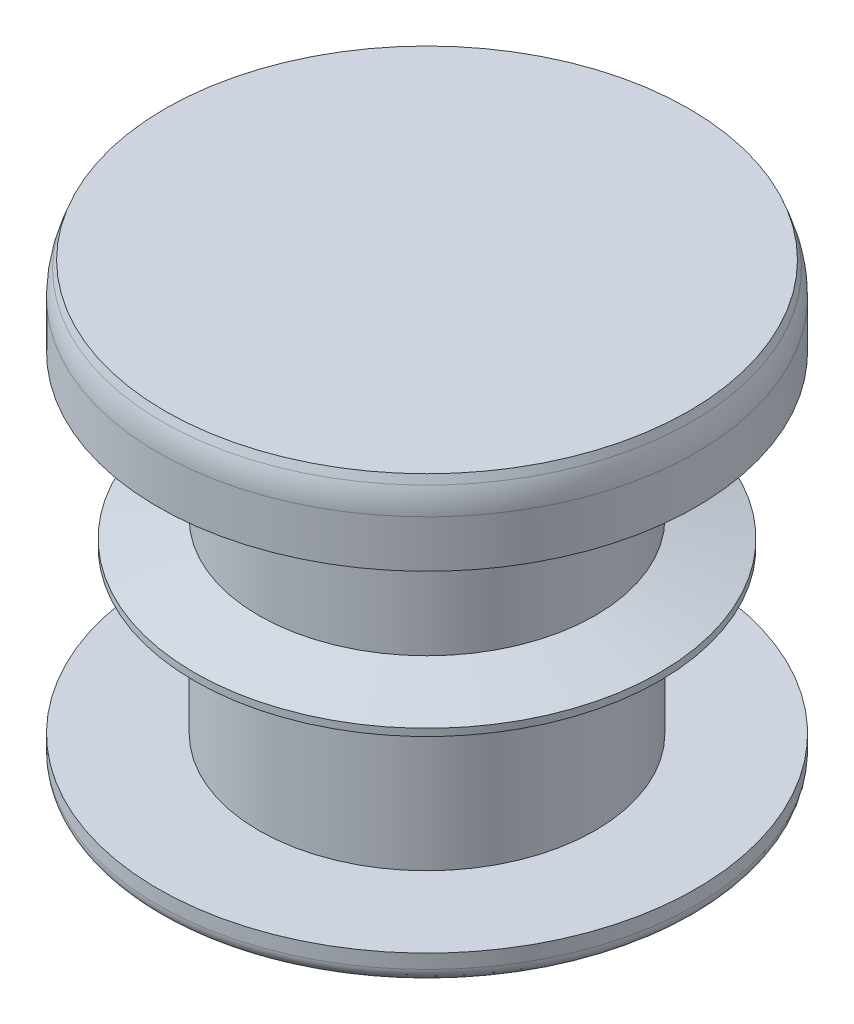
ISO-10303-21;
HEADER;
FILE_DESCRIPTION(('STEP AP214'),'2;1');
FILE_NAME('part.step','',(''),(''),'','','');
FILE_SCHEMA(('AUTOMOTIVE_DESIGN { 1 0 10303 214 1 1 1 1 }'));
ENDSEC;
DATA;
#1=APPLICATION_CONTEXT('core data for automotive mechanical design processes');
#2=APPLICATION_PROTOCOL_DEFINITION('international standard','automotive_design',2000,#1);
#3=PRODUCT_CONTEXT('',#1,'mechanical');
#4=PRODUCT('Part','Part','',(#3));
#5=PRODUCT_RELATED_PRODUCT_CATEGORY('part','',(#4));
#6=PRODUCT_DEFINITION_FORMATION('','',#4);
#7=PRODUCT_DEFINITION_CONTEXT('part definition',#1,'design');
#8=PRODUCT_DEFINITION('design','',#6,#7);
#9=PRODUCT_DEFINITION_SHAPE('','',#8);
#10=(LENGTH_UNIT() NAMED_UNIT(*) SI_UNIT(.MILLI.,.METRE.));
#11=(NAMED_UNIT(*) PLANE_ANGLE_UNIT() SI_UNIT($,.RADIAN.));
#12=(NAMED_UNIT(*) SI_UNIT($,.STERADIAN.) SOLID_ANGLE_UNIT());
#13=UNCERTAINTY_MEASURE_WITH_UNIT(LENGTH_MEASURE(1.E-05),#10,'distance_accuracy_value','');
#14=(GEOMETRIC_REPRESENTATION_CONTEXT(3) GLOBAL_UNCERTAINTY_ASSIGNED_CONTEXT((#13)) GLOBAL_UNIT_ASSIGNED_CONTEXT((#10,
#11,#12)) REPRESENTATION_CONTEXT('',''));
#15=CARTESIAN_POINT('',(0.,0.,0.));
#16=DIRECTION('',(0.,0.,1.));
#17=DIRECTION('',(1.,0.,0.));
#18=AXIS2_PLACEMENT_3D('',#15,#16,#17);
#19=CARTESIAN_POINT('',(3.66,0.,0.));
#20=DIRECTION('',(0.,-1.,0.));
#21=DIRECTION('',(1.,0.,0.));
#22=AXIS2_PLACEMENT_3D('',#19,#20,#21);
#23=PLANE('',#22);
#24=CARTESIAN_POINT('',(0.,0.,0.));
#25=DIRECTION('',(0.,1.,0.));
#26=DIRECTION('',(-1.,0.,0.));
#27=AXIS2_PLACEMENT_3D('',#24,#25,#26);
#28=CIRCLE('',#27,3.66);
#29=CARTESIAN_POINT('',(-3.66,0.,0.));
#30=VERTEX_POINT('',#29);
#31=EDGE_CURVE('E99',#30,#30,#28,.T.);
#32=ORIENTED_EDGE('',*,*,#31,.T.);
#33=EDGE_LOOP('',(#32));
#34=FACE_BOUND('',#33,.T.);
#35=ADVANCED_FACE('F38',(#34),#23,.F.);
#36=CARTESIAN_POINT('',(0.500000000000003,-7.99956969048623,0.));
#37=DIRECTION('',(0.,1.,0.));
#38=DIRECTION('',(-1.,0.,0.));
#39=AXIS2_PLACEMENT_3D('',#36,#37,#38);
#40=PLANE('',#39);
#41=CARTESIAN_POINT('',(0.,-7.99956969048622,0.));
#42=DIRECTION('',(0.,1.,0.));
#43=DIRECTION('',(-1.,0.,0.));
#44=AXIS2_PLACEMENT_3D('',#41,#42,#43);
#45=CIRCLE('',#44,0.5);
#46=CARTESIAN_POINT('',(-0.499999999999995,-7.99956969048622,0.));
#47=VERTEX_POINT('',#46);
#48=EDGE_CURVE('E65',#47,#47,#45,.T.);
#49=ORIENTED_EDGE('',*,*,#48,.F.);
#50=EDGE_LOOP('',(#49));
#51=FACE_BOUND('',#50,.T.);
#52=ADVANCED_FACE('F117',(#51),#40,.F.);
#53=CARTESIAN_POINT('',(0.,-7.99956969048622,0.));
#54=DIRECTION('',(0.,1.,0.));
#55=DIRECTION('',(-1.,0.,0.));
#56=AXIS2_PLACEMENT_3D('',#53,#54,#55);
#57=CONICAL_SURFACE('',#56,0.5,1.02974425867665);
#58=CARTESIAN_POINT('',(0.,-6.09904297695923,0.));
#59=DIRECTION('',(0.,-1.,0.));
#60=DIRECTION('',(1.,0.,0.));
#61=AXIS2_PLACEMENT_3D('',#58,#59,#60);
#62=CIRCLE('',#61,3.66300761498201);
#63=CARTESIAN_POINT('',(-3.66300761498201,-6.09904297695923,0.));
#64=VERTEX_POINT('',#63);
#65=EDGE_CURVE('E52',#64,#64,#62,.T.);
#66=CARTESIAN_POINT('',(-3.66300761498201,-6.09904297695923,0.));
#67=CARTESIAN_POINT('',(-3.63005961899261,-6.11884013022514,0.));
#68=CARTESIAN_POINT('',(-3.59711162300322,-6.13863728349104,0.));
#69=CARTESIAN_POINT('',(-3.53121563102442,-6.17823159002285,0.));
#70=CARTESIAN_POINT('',(-3.49826763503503,-6.19802874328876,0.));
#71=CARTESIAN_POINT('',(-3.43237164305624,-6.23762304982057,0.));
#72=CARTESIAN_POINT('',(-3.39942364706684,-6.25742020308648,0.));
#73=CARTESIAN_POINT('',(-3.33352765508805,-6.29701450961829,0.));
#74=CARTESIAN_POINT('',(-3.30057965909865,-6.3168116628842,0.));
#75=CARTESIAN_POINT('',(-3.23468366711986,-6.35640596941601,0.));
#76=CARTESIAN_POINT('',(-3.20173567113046,-6.37620312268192,0.));
#77=CARTESIAN_POINT('',(-3.13583967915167,-6.41579742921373,0.));
#78=CARTESIAN_POINT('',(-3.10289168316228,-6.43559458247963,0.));
#79=CARTESIAN_POINT('',(-3.03699569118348,-6.47518888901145,0.));
#80=CARTESIAN_POINT('',(-3.00404769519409,-6.49498604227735,0.));
#81=CARTESIAN_POINT('',(-2.9381517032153,-6.53458034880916,0.));
#82=CARTESIAN_POINT('',(-2.9052037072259,-6.55437750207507,0.));
#83=CARTESIAN_POINT('',(-2.83930771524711,-6.59397180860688,0.));
#84=CARTESIAN_POINT('',(-2.80635971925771,-6.61376896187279,0.));
#85=CARTESIAN_POINT('',(-2.74046372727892,-6.6533632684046,0.));
#86=CARTESIAN_POINT('',(-2.70751573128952,-6.67316042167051,0.));
#87=CARTESIAN_POINT('',(-2.64161973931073,-6.71275472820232,0.));
#88=CARTESIAN_POINT('',(-2.60867174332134,-6.73255188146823,0.));
#89=CARTESIAN_POINT('',(-2.54277575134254,-6.77214618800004,0.));
#90=CARTESIAN_POINT('',(-2.50982775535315,-6.79194334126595,0.));
#91=CARTESIAN_POINT('',(-2.44393176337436,-6.83153764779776,0.));
#92=CARTESIAN_POINT('',(-2.41098376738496,-6.85133480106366,0.));
#93=CARTESIAN_POINT('',(-2.34508777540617,-6.89092910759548,0.));
#94=CARTESIAN_POINT('',(-2.31213977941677,-6.91072626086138,0.));
#95=CARTESIAN_POINT('',(-2.24624378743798,-6.9503205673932,0.));
#96=CARTESIAN_POINT('',(-2.21329579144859,-6.9701177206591,0.));
#97=CARTESIAN_POINT('',(-2.14739979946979,-7.00971202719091,0.));
#98=CARTESIAN_POINT('',(-2.1144518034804,-7.02950918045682,0.));
#99=CARTESIAN_POINT('',(-2.0485558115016,-7.06910348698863,0.));
#100=CARTESIAN_POINT('',(-2.01560781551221,-7.08890064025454,0.));
#101=CARTESIAN_POINT('',(-1.94971182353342,-7.12849494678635,0.));
#102=CARTESIAN_POINT('',(-1.91676382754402,-7.14829210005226,0.));
#103=CARTESIAN_POINT('',(-1.85086783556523,-7.18788640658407,0.));
#104=CARTESIAN_POINT('',(-1.81791983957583,-7.20768355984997,0.));
#105=CARTESIAN_POINT('',(-1.75202384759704,-7.24727786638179,0.));
#106=CARTESIAN_POINT('',(-1.71907585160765,-7.26707501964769,0.));
#107=CARTESIAN_POINT('',(-1.65317985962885,-7.3066693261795,0.));
#108=CARTESIAN_POINT('',(-1.62023186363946,-7.32646647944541,0.));
#109=CARTESIAN_POINT('',(-1.55433587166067,-7.36606078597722,0.));
#110=CARTESIAN_POINT('',(-1.52138787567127,-7.38585793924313,0.));
#111=CARTESIAN_POINT('',(-1.45549188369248,-7.42545224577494,0.));
#112=CARTESIAN_POINT('',(-1.42254388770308,-7.44524939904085,0.));
#113=CARTESIAN_POINT('',(-1.35664789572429,-7.48484370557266,0.));
#114=CARTESIAN_POINT('',(-1.32369989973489,-7.50464085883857,0.));
#115=CARTESIAN_POINT('',(-1.2578039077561,-7.54423516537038,0.));
#116=CARTESIAN_POINT('',(-1.22485591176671,-7.56403231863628,0.));
#117=CARTESIAN_POINT('',(-1.15895991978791,-7.6036266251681,0.));
#118=CARTESIAN_POINT('',(-1.12601192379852,-7.623423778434,0.));
#119=CARTESIAN_POINT('',(-1.06011593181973,-7.66301808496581,0.));
#120=CARTESIAN_POINT('',(-1.02716793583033,-7.68281523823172,0.));
#121=CARTESIAN_POINT('',(-0.961271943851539,-7.72240954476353,0.));
#122=CARTESIAN_POINT('',(-0.928323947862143,-7.74220669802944,0.));
#123=CARTESIAN_POINT('',(-0.862427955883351,-7.78180100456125,0.));
#124=CARTESIAN_POINT('',(-0.829479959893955,-7.80159815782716,0.));
#125=CARTESIAN_POINT('',(-0.763583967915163,-7.84119246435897,0.));
#126=CARTESIAN_POINT('',(-0.730635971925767,-7.86098961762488,0.));
#127=CARTESIAN_POINT('',(-0.664739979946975,-7.90058392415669,0.));
#128=CARTESIAN_POINT('',(-0.631791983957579,-7.9203810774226,0.));
#129=CARTESIAN_POINT('',(-0.565895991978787,-7.95997538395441,0.));
#130=CARTESIAN_POINT('',(-0.532947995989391,-7.97977253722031,0.));
#131=CARTESIAN_POINT('',(-0.499999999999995,-7.99956969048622,0.));
#132=B_SPLINE_CURVE_WITH_KNOTS('',3,(#66,#67,#68,#69,#70,#71,#72,#73,#74,#75,#76,#77,#78,#79,
#80,#81,#82,#83,#84,#85,#86,#87,#88,#89,#90,#91,#92,#93,#94,#95,#96,#97,#98,#99,#100,#101,#102,
#103,#104,#105,#106,#107,#108,#109,#110,#111,#112,#113,#114,#115,#116,#117,#118,#119,#120,#121,
#122,#123,#124,#125,#126,#127,#128,#129,#130,#131),.UNSPECIFIED.,.F.,.F.,(4,2,2,2,2,2,2,2,2,2,2,
2,2,2,2,2,2,2,2,2,2,2,2,2,2,2,2,2,2,2,2,2,4),(0.,0.115314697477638,0.230629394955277,
0.345944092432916,0.461258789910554,0.576573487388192,0.691888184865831,0.807202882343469,
0.922517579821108,1.03783227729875,1.15314697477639,1.26846167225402,1.38377636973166,
1.4990910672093,1.61440576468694,1.72972046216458,1.84503515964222,1.96034985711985,
2.07566455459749,2.19097925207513,2.30629394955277,2.42160864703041,2.53692334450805,
2.65223804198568,2.76755273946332,2.88286743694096,2.9981821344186,3.11349683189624,
3.22881152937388,3.34412622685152,3.45944092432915,3.57475562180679,3.69007031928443),.UNSPECIFIED.);
#133=EDGE_CURVE('BSEAM122',#64,#47,#132,.T.);
#134=ORIENTED_EDGE('',*,*,#65,.T.);
#135=ORIENTED_EDGE('',*,*,#48,.T.);
#136=ORIENTED_EDGE('',*,*,#133,.T.);
#137=ORIENTED_EDGE('',*,*,#133,.F.);
#138=EDGE_LOOP('',(#134,#136,#135,#137));
#139=FACE_BOUND('',#138,.T.);
#140=ADVANCED_FACE('F122',(#139),#57,.T.);
#141=CARTESIAN_POINT('',(0.,0.,0.));
#142=DIRECTION('',(0.,1.,0.));
#143=DIRECTION('',(-1.,0.,0.));
#144=AXIS2_PLACEMENT_3D('',#141,#142,#143);
#145=CYLINDRICAL_SURFACE('',#144,3.76);
#146=CARTESIAN_POINT('',(0.,-5.92760951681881,0.));
#147=DIRECTION('',(0.,-1.,0.));
#148=DIRECTION('',(1.,0.,0.));
#149=AXIS2_PLACEMENT_3D('',#146,#147,#148);
#150=CIRCLE('',#149,3.76);
#151=CARTESIAN_POINT('',(3.76,-5.9276095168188,0.));
#152=VERTEX_POINT('',#151);
#153=EDGE_CURVE('E59',#152,#152,#150,.F.);
#154=ORIENTED_EDGE('',*,*,#153,.T.);
#155=EDGE_LOOP('',(#154));
#156=FACE_BOUND('',#155,.T.);
#157=CARTESIAN_POINT('',(0.,-5.73,0.));
#158=DIRECTION('',(0.,1.,0.));
#159=DIRECTION('',(-1.,0.,0.));
#160=AXIS2_PLACEMENT_3D('',#157,#158,#159);
#161=CIRCLE('',#160,3.76);
#162=CARTESIAN_POINT('',(-3.76,-5.73,0.));
#163=VERTEX_POINT('',#162);
#164=EDGE_CURVE('E68',#163,#163,#161,.T.);
#165=ORIENTED_EDGE('',*,*,#164,.F.);
#166=EDGE_LOOP('',(#165));
#167=FACE_BOUND('',#166,.T.);
#168=ADVANCED_FACE('F128',(#156,#167),#145,.T.);
#169=CARTESIAN_POINT('',(3.76,-5.73,0.));
#170=DIRECTION('',(0.,-1.,0.));
#171=DIRECTION('',(1.,0.,0.));
#172=AXIS2_PLACEMENT_3D('',#169,#170,#171);
#173=PLANE('',#172);
#174=CARTESIAN_POINT('',(0.,-5.73,0.));
#175=DIRECTION('',(0.,1.,0.));
#176=DIRECTION('',(-1.,0.,0.));
#177=AXIS2_PLACEMENT_3D('',#174,#175,#176);
#178=CIRCLE('',#177,2.35);
#179=CARTESIAN_POINT('',(-2.35,-5.73,0.));
#180=VERTEX_POINT('',#179);
#181=EDGE_CURVE('E72',#180,#180,#178,.T.);
#182=ORIENTED_EDGE('',*,*,#181,.F.);
#183=EDGE_LOOP('',(#182));
#184=FACE_BOUND('',#183,.T.);
#185=ORIENTED_EDGE('',*,*,#164,.T.);
#186=EDGE_LOOP('',(#185));
#187=FACE_BOUND('',#186,.T.);
#188=ADVANCED_FACE('F132',(#184,#187),#173,.F.);
#189=CARTESIAN_POINT('',(0.,0.,0.));
#190=DIRECTION('',(0.,1.,0.));
#191=DIRECTION('',(-1.,0.,0.));
#192=AXIS2_PLACEMENT_3D('',#189,#190,#191);
#193=CYLINDRICAL_SURFACE('',#192,2.35);
#194=CARTESIAN_POINT('',(0.,-3.71115427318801,0.));
#195=DIRECTION('',(0.,1.,0.));
#196=DIRECTION('',(-1.,0.,0.));
#197=AXIS2_PLACEMENT_3D('',#194,#195,#196);
#198=CIRCLE('',#197,2.35);
#199=CARTESIAN_POINT('',(-2.35,-3.71115427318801,0.));
#200=VERTEX_POINT('',#199);
#201=EDGE_CURVE('E76',#200,#200,#198,.T.);
#202=ORIENTED_EDGE('',*,*,#201,.F.);
#203=EDGE_LOOP('',(#202));
#204=FACE_BOUND('',#203,.T.);
#205=ORIENTED_EDGE('',*,*,#181,.T.);
#206=EDGE_LOOP('',(#205));
#207=FACE_BOUND('',#206,.T.);
#208=ADVANCED_FACE('F136',(#204,#207),#193,.T.);
#209=CARTESIAN_POINT('',(0.,-3.71115427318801,0.));
#210=DIRECTION('',(0.,1.,0.));
#211=DIRECTION('',(-1.,0.,0.));
#212=AXIS2_PLACEMENT_3D('',#209,#210,#211);
#213=CONICAL_SURFACE('',#212,2.35,1.30899693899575);
#214=CARTESIAN_POINT('',(0.,-3.47,0.));
#215=DIRECTION('',(0.,1.,0.));
#216=DIRECTION('',(-1.,0.,0.));
#217=AXIS2_PLACEMENT_3D('',#214,#215,#216);
#218=CIRCLE('',#217,3.25);
#219=CARTESIAN_POINT('',(-3.25,-3.47,0.));
#220=VERTEX_POINT('',#219);
#221=EDGE_CURVE('E80',#220,#220,#218,.T.);
#222=ORIENTED_EDGE('',*,*,#221,.F.);
#223=EDGE_LOOP('',(#222));
#224=FACE_BOUND('',#223,.T.);
#225=ORIENTED_EDGE('',*,*,#201,.T.);
#226=EDGE_LOOP('',(#225));
#227=FACE_BOUND('',#226,.T.);
#228=ADVANCED_FACE('F140',(#224,#227),#213,.T.);
#229=CARTESIAN_POINT('',(0.,0.,0.));
#230=DIRECTION('',(0.,1.,0.));
#231=DIRECTION('',(-1.,0.,0.));
#232=AXIS2_PLACEMENT_3D('',#229,#230,#231);
#233=CYLINDRICAL_SURFACE('',#232,3.25);
#234=CARTESIAN_POINT('',(0.,-3.37,0.));
#235=DIRECTION('',(0.,1.,0.));
#236=DIRECTION('',(-1.,0.,0.));
#237=AXIS2_PLACEMENT_3D('',#234,#235,#236);
#238=CIRCLE('',#237,3.25);
#239=CARTESIAN_POINT('',(-3.25,-3.37,0.));
#240=VERTEX_POINT('',#239);
#241=EDGE_CURVE('E83',#240,#240,#238,.T.);
#242=ORIENTED_EDGE('',*,*,#241,.F.);
#243=EDGE_LOOP('',(#242));
#244=FACE_BOUND('',#243,.T.);
#245=ORIENTED_EDGE('',*,*,#221,.T.);
#246=EDGE_LOOP('',(#245));
#247=FACE_BOUND('',#246,.T.);
#248=ADVANCED_FACE('F144',(#244,#247),#233,.T.);
#249=CARTESIAN_POINT('',(0.,-3.37,0.));
#250=DIRECTION('',(0.,-1.,0.));
#251=DIRECTION('',(1.,0.,0.));
#252=AXIS2_PLACEMENT_3D('',#249,#250,#251);
#253=CONICAL_SURFACE('',#252,3.25,1.30899693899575);
#254=CARTESIAN_POINT('',(0.,-3.12884572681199,0.));
#255=DIRECTION('',(0.,1.,0.));
#256=DIRECTION('',(-1.,0.,0.));
#257=AXIS2_PLACEMENT_3D('',#254,#255,#256);
#258=CIRCLE('',#257,2.35);
#259=CARTESIAN_POINT('',(-2.35,-3.12884572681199,0.));
#260=VERTEX_POINT('',#259);
#261=EDGE_CURVE('E87',#260,#260,#258,.T.);
#262=ORIENTED_EDGE('',*,*,#261,.F.);
#263=EDGE_LOOP('',(#262));
#264=FACE_BOUND('',#263,.T.);
#265=ORIENTED_EDGE('',*,*,#241,.T.);
#266=EDGE_LOOP('',(#265));
#267=FACE_BOUND('',#266,.T.);
#268=ADVANCED_FACE('F148',(#264,#267),#253,.T.);
#269=CARTESIAN_POINT('',(0.,0.,0.));
#270=DIRECTION('',(0.,1.,0.));
#271=DIRECTION('',(-1.,0.,0.));
#272=AXIS2_PLACEMENT_3D('',#269,#270,#271);
#273=CYLINDRICAL_SURFACE('',#272,2.35);
#274=CARTESIAN_POINT('',(0.,-1.11,0.));
#275=DIRECTION('',(0.,1.,0.));
#276=DIRECTION('',(-1.,0.,0.));
#277=AXIS2_PLACEMENT_3D('',#274,#275,#276);
#278=CIRCLE('',#277,2.35);
#279=CARTESIAN_POINT('',(-2.35,-1.11,0.));
#280=VERTEX_POINT('',#279);
#281=EDGE_CURVE('E91',#280,#280,#278,.T.);
#282=ORIENTED_EDGE('',*,*,#281,.F.);
#283=EDGE_LOOP('',(#282));
#284=FACE_BOUND('',#283,.T.);
#285=ORIENTED_EDGE('',*,*,#261,.T.);
#286=EDGE_LOOP('',(#285));
#287=FACE_BOUND('',#286,.T.);
#288=ADVANCED_FACE('F152',(#284,#287),#273,.T.);
#289=CARTESIAN_POINT('',(2.35,-1.11,0.));
#290=DIRECTION('',(0.,1.,0.));
#291=DIRECTION('',(-1.,0.,0.));
#292=AXIS2_PLACEMENT_3D('',#289,#290,#291);
#293=PLANE('',#292);
#294=CARTESIAN_POINT('',(0.,-1.11,0.));
#295=DIRECTION('',(0.,1.,0.));
#296=DIRECTION('',(-1.,0.,0.));
#297=AXIS2_PLACEMENT_3D('',#294,#295,#296);
#298=CIRCLE('',#297,3.76);
#299=CARTESIAN_POINT('',(-3.76,-1.11,0.));
#300=VERTEX_POINT('',#299);
#301=EDGE_CURVE('E95',#300,#300,#298,.T.);
#302=ORIENTED_EDGE('',*,*,#301,.F.);
#303=EDGE_LOOP('',(#302));
#304=FACE_BOUND('',#303,.T.);
#305=ORIENTED_EDGE('',*,*,#281,.T.);
#306=EDGE_LOOP('',(#305));
#307=FACE_BOUND('',#306,.T.);
#308=ADVANCED_FACE('F114',(#304,#307),#293,.F.);
#309=CARTESIAN_POINT('',(0.,0.,0.));
#310=DIRECTION('',(0.,1.,0.));
#311=DIRECTION('',(-1.,0.,0.));
#312=AXIS2_PLACEMENT_3D('',#309,#310,#311);
#313=CYLINDRICAL_SURFACE('',#312,3.76);
#314=CARTESIAN_POINT('',(0.,-0.451074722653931,0.));
#315=DIRECTION('',(0.,-1.,0.));
#316=DIRECTION('',(1.,0.,0.));
#317=AXIS2_PLACEMENT_3D('',#314,#315,#316);
#318=CIRCLE('',#317,3.76);
#319=CARTESIAN_POINT('',(3.76,-0.45107472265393,0.));
#320=VERTEX_POINT('',#319);
#321=EDGE_CURVE('E10',#320,#320,#318,.T.);
#322=ORIENTED_EDGE('',*,*,#321,.T.);
#323=EDGE_LOOP('',(#322));
#324=FACE_BOUND('',#323,.T.);
#325=ORIENTED_EDGE('',*,*,#301,.T.);
#326=EDGE_LOOP('',(#325));
#327=FACE_BOUND('',#326,.T.);
#328=ADVANCED_FACE('F107',(#324,#327),#313,.T.);
#329=CARTESIAN_POINT('',(0.,-0.274747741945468,0.));
#330=DIRECTION('',(0.,-1.,0.));
#331=DIRECTION('',(1.,0.,0.));
#332=AXIS2_PLACEMENT_3D('',#329,#330,#331);
#333=CONICAL_SURFACE('',#332,3.76,0.349065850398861);
#334=CARTESIAN_POINT('',(0.,-0.109054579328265,0.));
#335=DIRECTION('',(0.,1.,0.));
#336=DIRECTION('',(-1.,0.,0.));
#337=AXIS2_PLACEMENT_3D('',#334,#335,#336);
#338=CIRCLE('',#337,3.69969262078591);
#339=CARTESIAN_POINT('',(-3.69969262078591,-0.109054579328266,0.));
#340=VERTEX_POINT('',#339);
#341=EDGE_CURVE('E46',#340,#340,#338,.T.);
#342=ORIENTED_EDGE('',*,*,#341,.T.);
#343=EDGE_LOOP('',(#342));
#344=FACE_BOUND('',#343,.T.);
#345=ORIENTED_EDGE('',*,*,#31,.F.);
#346=EDGE_LOOP('',(#345));
#347=FACE_BOUND('',#346,.T.);
#348=ADVANCED_FACE('F104',(#344,#347),#333,.T.);
#349=CARTESIAN_POINT('',(0.,-5.92760951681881,0.));
#350=DIRECTION('',(0.,-1.,0.));
#351=DIRECTION('',(1.,0.,0.));
#352=AXIS2_PLACEMENT_3D('',#349,#350,#351);
#353=TOROIDAL_SURFACE('',#352,3.56,0.2);
#354=ORIENTED_EDGE('',*,*,#65,.F.);
#355=EDGE_LOOP('',(#354));
#356=FACE_BOUND('',#355,.T.);
#357=ORIENTED_EDGE('',*,*,#153,.F.);
#358=EDGE_LOOP('',(#357));
#359=FACE_BOUND('',#358,.T.);
#360=ADVANCED_FACE('F106',(#356,#359),#353,.T.);
#361=CARTESIAN_POINT('',(0.,-0.451074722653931,0.));
#362=DIRECTION('',(0.,-1.,0.));
#363=DIRECTION('',(1.,0.,0.));
#364=AXIS2_PLACEMENT_3D('',#361,#362,#363);
#365=TOROIDAL_SURFACE('',#364,2.76,1.);
#366=ORIENTED_EDGE('',*,*,#321,.F.);
#367=EDGE_LOOP('',(#366));
#368=FACE_BOUND('',#367,.T.);
#369=ORIENTED_EDGE('',*,*,#341,.F.);
#370=EDGE_LOOP('',(#369));
#371=FACE_BOUND('',#370,.T.);
#372=ADVANCED_FACE('F40',(#368,#371),#365,.T.);
#373=CLOSED_SHELL('',(#35,#52,#140,#168,#188,#208,#228,#248,#268,#288,#308,#328,#348,#360,#372));
#374=MANIFOLD_SOLID_BREP('B2',#373);
#375=ADVANCED_BREP_SHAPE_REPRESENTATION('',(#18,#374),#14);
#376=SHAPE_DEFINITION_REPRESENTATION(#9,#375);
ENDSEC;
END-ISO-10303-21;
